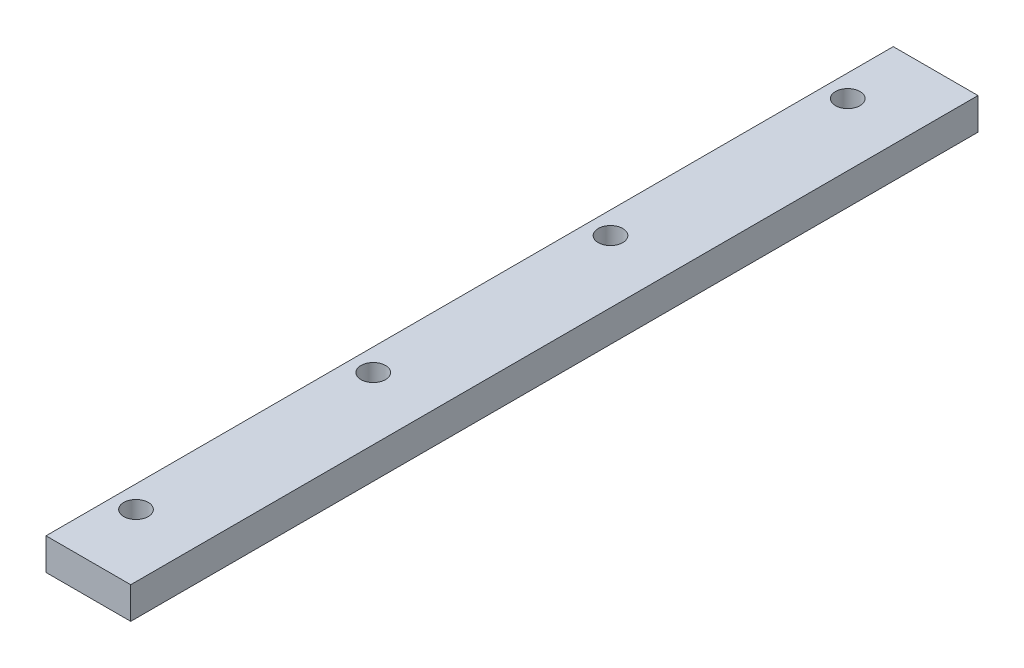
from build123d import *

# Parameters (mm, degrees)
SKETCH1_W                   = 10.16
SKETCH1_H                   = 3.81
EXTRUDE1_DEPTH              = 101.6
F_32_0_116_DIAMETER_HOLE1_D = 2.9464


with BuildPart() as part:
    # Sketch1 → Extrude1 (new body)
    with BuildSketch(Plane.XY):
        with Locations((-0.237000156, 1.905)):
            Rectangle(SKETCH1_W, SKETCH1_H)
    extrude(amount=EXTRUDE1_DEPTH)

    # 32 _0.116_ Diameter Hole1 (through all)
    with Locations(Plane(origin=(0, 3.81, 0), x_dir=(-1, 0, 0), z_dir=(0, 1, 0))):
        with Locations((2.650000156, 8.128), (2.650000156, 36.576), (2.650000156, 65.024), (2.650000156, 93.472)):
            Hole(F_32_0_116_DIAMETER_HOLE1_D / 2)


solid = part.part
